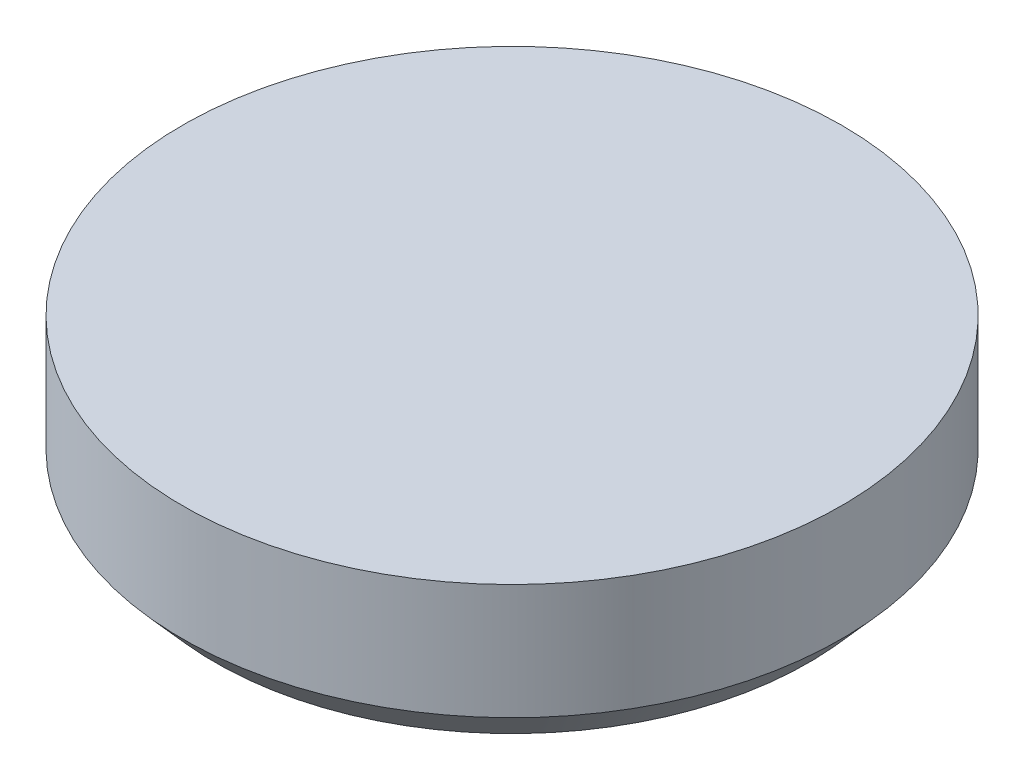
from build123d import *


with BuildPart() as part:
    # Sketch 1 → Revolve 1 (revolve)
    with BuildSketch(Plane.XY, mode=Mode.PRIVATE) as revolve_1_sk:
        Polygon((0, 370), (800, 370), (800, 90), (720, 0), (0, 0), align=None)
    revolve(revolve_1_sk.sketch.rotate(Axis((0, 0, 0), (0, 1, 0)), 90), axis=Axis((0, 0, 0), (0, 1, 0)))


solid = part.part
